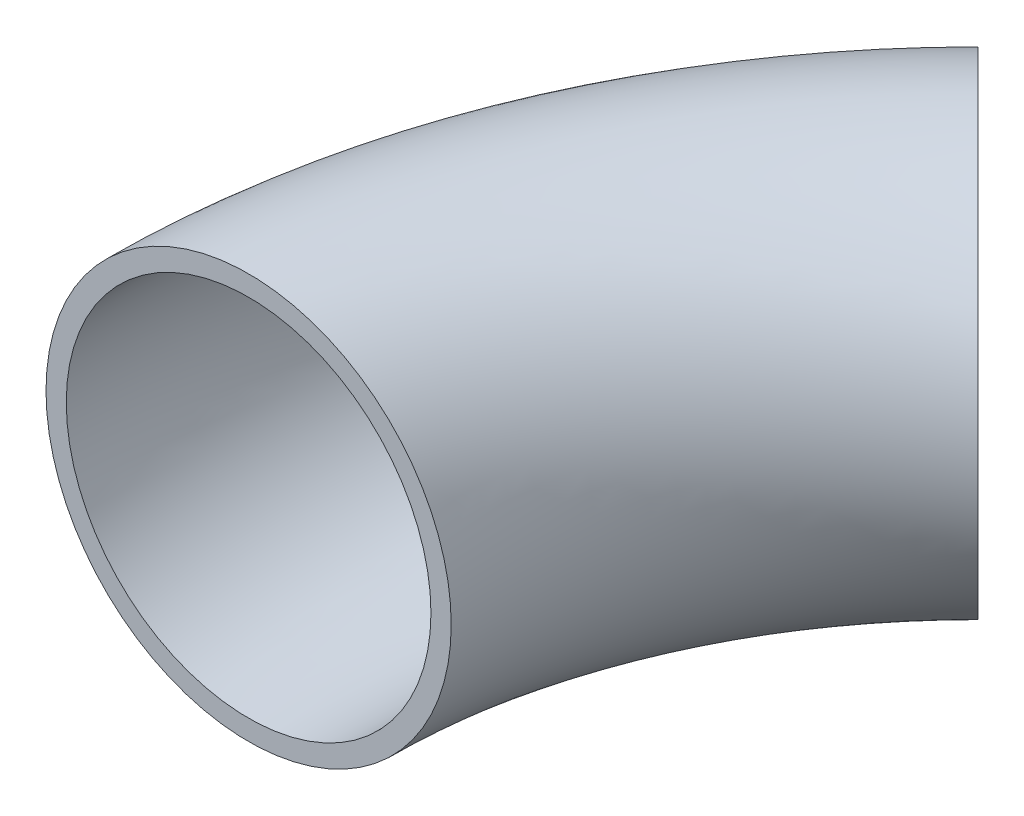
from build123d import *

# Parameters (mm, degrees)
ESQUISSE1_R   = 15
ESQUISSE1_R_2 = 13.5


with BuildPart() as part:
    # Balayage-Mince2: sweep along a path in Esquisse2
    with BuildLine(Plane(origin=(0, 0, 0), x_dir=(1, 0, 0), z_dir=(0, 1, 0))) as balayage_mince2_path:
        ThreePointArc((0, 0), (4.110505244, 20.664905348), (15.816233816, 38.183766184))
    # Esquisse1 → Balayage-Mince2 (sweep)
    with BuildSketch(Plane.XY):
        Circle(ESQUISSE1_R)
        Circle(ESQUISSE1_R_2, mode=Mode.SUBTRACT)
    sweep(path=balayage_mince2_path.line)


solid = part.part
